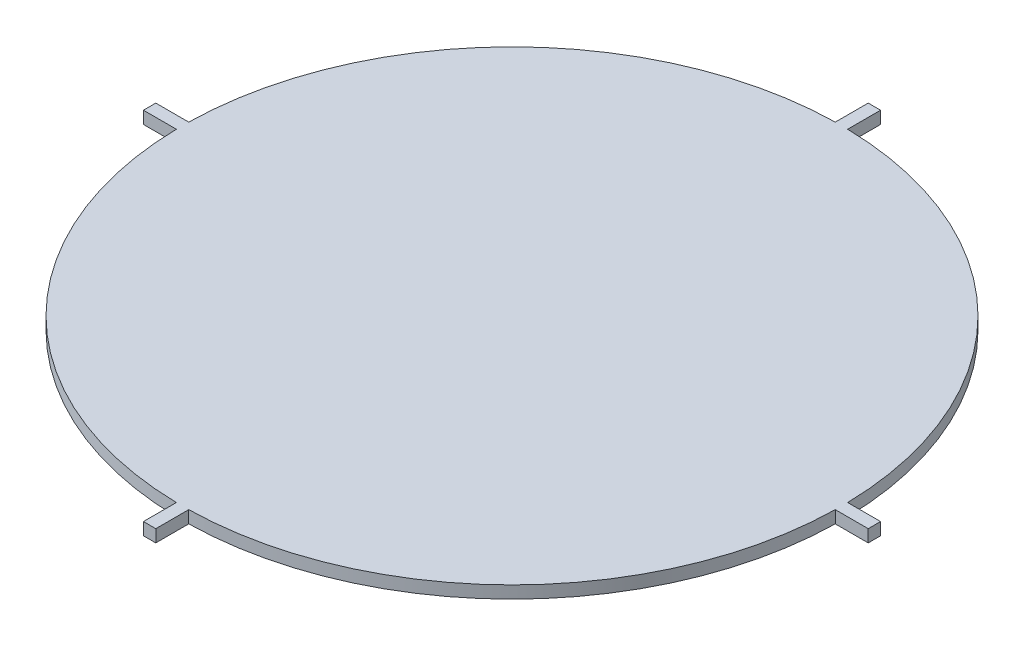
from build123d import *

# Parameters (mm, degrees)
BOSS_EXTRUDE1_DEPTH = 3


with BuildPart() as part:
    # Sketch1 → Boss-Extrude1 (new body)
    with BuildSketch(Plane(origin=(0, 0, 0), x_dir=(1, 0, 0), z_dir=(0, 1, 0))):
        with BuildLine():
            Line((87.985936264, 1.5), (79.985936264, 1.5))
            ThreePointArc((79.985936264, 1.5), (56.568542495, 56.568542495), (1.5, 79.985936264))
            Line((1.5, 79.985936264), (1.5, 87.985936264))
            Line((1.5, 87.985936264), (-1.5, 87.985936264))
            Line((-1.5, 87.985936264), (-1.5, 79.985936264))
            ThreePointArc((-1.5, 79.985936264), (-56.568542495, 56.568542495), (-79.985936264, 1.5))
            Line((-79.985936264, 1.5), (-87.985936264, 1.5))
            Line((-87.985936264, 1.5), (-87.985936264, -1.5))
            Line((-87.985936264, -1.5), (-79.985936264, -1.5))
            ThreePointArc((-79.985936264, -1.5), (-56.568542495, -56.568542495), (-1.5, -79.985936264))
            Line((-1.5, -79.985936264), (-1.5, -87.985936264))
            Line((-1.5, -87.985936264), (1.5, -87.985936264))
            Line((1.5, -87.985936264), (1.5, -79.985936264))
            ThreePointArc((1.5, -79.985936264), (56.568542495, -56.568542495), (79.985936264, -1.5))
            Line((79.985936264, -1.5), (87.985936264, -1.5))
            Line((87.985936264, -1.5), (87.985936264, 1.5))
        make_face()
    extrude(amount=BOSS_EXTRUDE1_DEPTH)


solid = part.part
